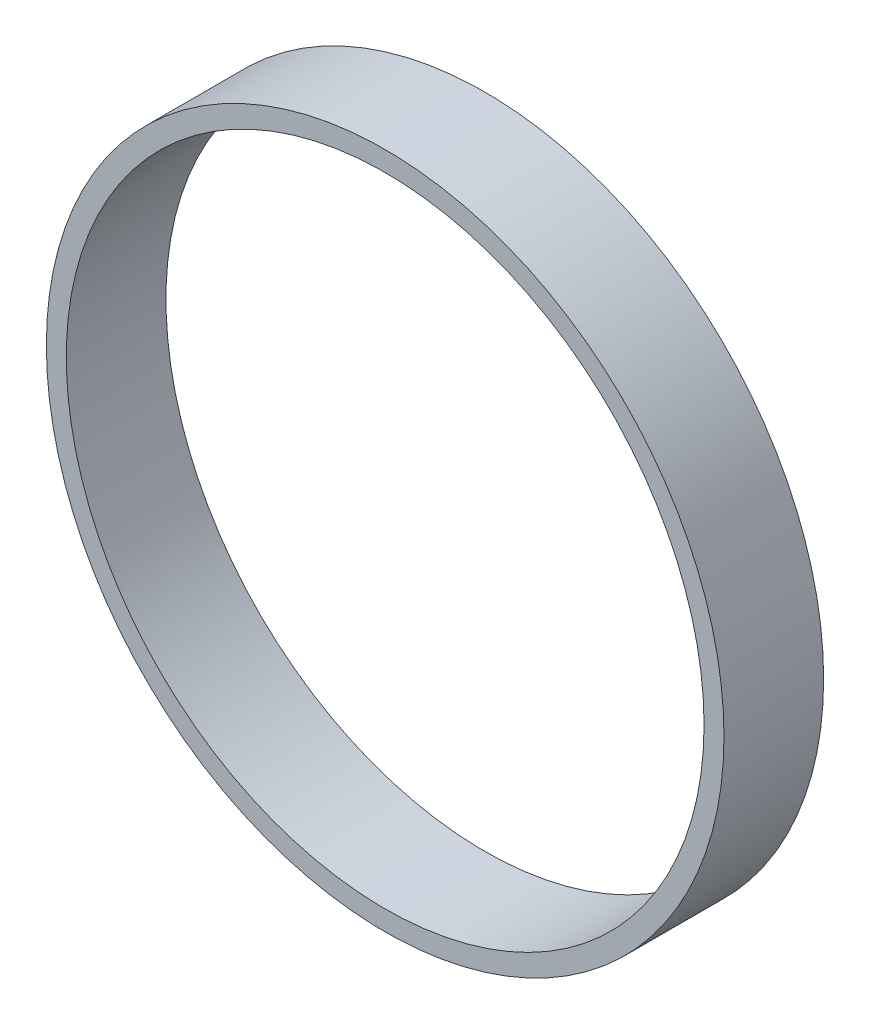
from build123d import *

# Parameters (mm, degrees)
SKETCH1_R           = 34
SKETCH1_R_2         = 32
BOSS_EXTRUDE1_DEPTH = 10


with BuildPart() as part:
    # Sketch1 → Boss-Extrude1 (new body)
    with BuildSketch(Plane.XY):
        Circle(SKETCH1_R)
        Circle(SKETCH1_R_2, mode=Mode.SUBTRACT)
    extrude(amount=BOSS_EXTRUDE1_DEPTH)


solid = part.part
